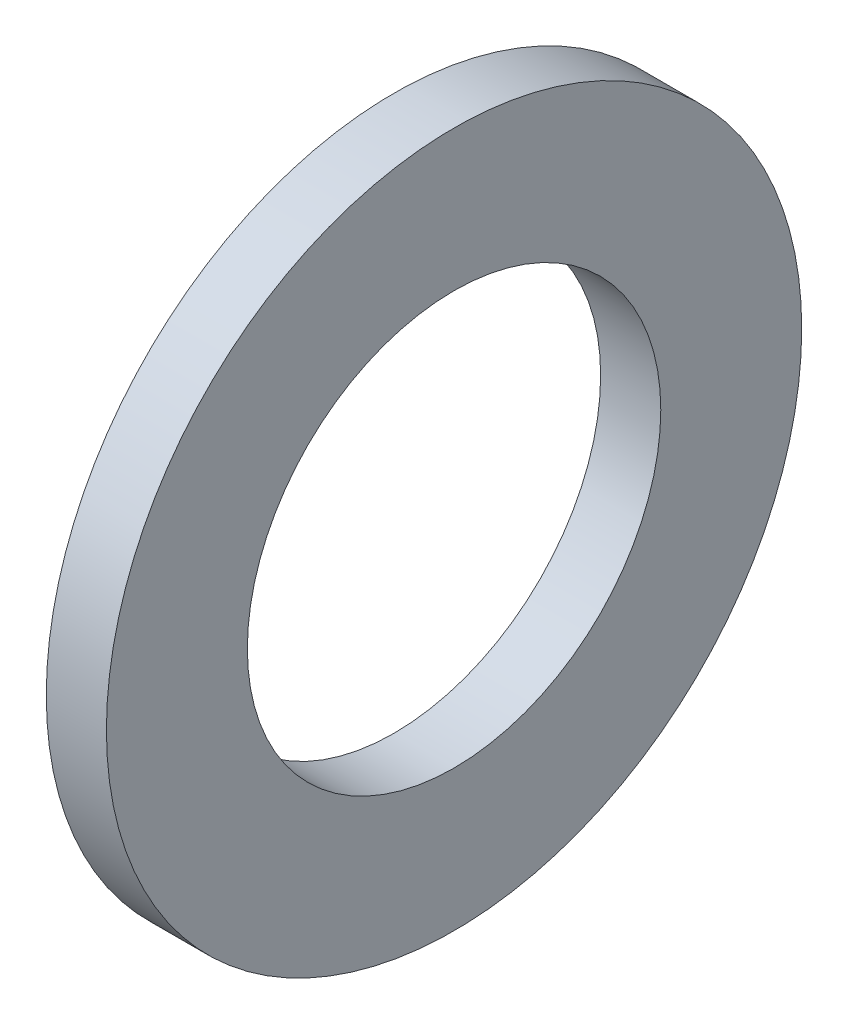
ISO-10303-21;
HEADER;
FILE_DESCRIPTION(('STEP AP214'),'2;1');
FILE_NAME('part.step','',(''),(''),'','','');
FILE_SCHEMA(('AUTOMOTIVE_DESIGN { 1 0 10303 214 1 1 1 1 }'));
ENDSEC;
DATA;
#1=APPLICATION_CONTEXT('core data for automotive mechanical design processes');
#2=APPLICATION_PROTOCOL_DEFINITION('international standard','automotive_design',2000,#1);
#3=PRODUCT_CONTEXT('',#1,'mechanical');
#4=PRODUCT('Part','Part','',(#3));
#5=PRODUCT_RELATED_PRODUCT_CATEGORY('part','',(#4));
#6=PRODUCT_DEFINITION_FORMATION('','',#4);
#7=PRODUCT_DEFINITION_CONTEXT('part definition',#1,'design');
#8=PRODUCT_DEFINITION('design','',#6,#7);
#9=PRODUCT_DEFINITION_SHAPE('','',#8);
#10=(LENGTH_UNIT() NAMED_UNIT(*) SI_UNIT(.MILLI.,.METRE.));
#11=(NAMED_UNIT(*) PLANE_ANGLE_UNIT() SI_UNIT($,.RADIAN.));
#12=(NAMED_UNIT(*) SI_UNIT($,.STERADIAN.) SOLID_ANGLE_UNIT());
#13=UNCERTAINTY_MEASURE_WITH_UNIT(LENGTH_MEASURE(1.E-05),#10,'distance_accuracy_value','');
#14=(GEOMETRIC_REPRESENTATION_CONTEXT(3) GLOBAL_UNCERTAINTY_ASSIGNED_CONTEXT((#13)) GLOBAL_UNIT_ASSIGNED_CONTEXT((#10,
#11,#12)) REPRESENTATION_CONTEXT('',''));
#15=CARTESIAN_POINT('',(0.,0.,0.));
#16=DIRECTION('',(0.,0.,1.));
#17=DIRECTION('',(1.,0.,0.));
#18=AXIS2_PLACEMENT_3D('',#15,#16,#17);
#19=CARTESIAN_POINT('',(-34.9249999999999,0.,0.));
#20=DIRECTION('',(-1.,0.,0.));
#21=DIRECTION('',(0.,0.,1.));
#22=AXIS2_PLACEMENT_3D('',#19,#20,#21);
#23=CYLINDRICAL_SURFACE('',#22,11.);
#24=CARTESIAN_POINT('',(0.,0.,0.));
#25=DIRECTION('',(-1.,0.,0.));
#26=DIRECTION('',(0.,0.,1.));
#27=AXIS2_PLACEMENT_3D('',#24,#25,#26);
#28=CIRCLE('',#27,11.);
#29=CARTESIAN_POINT('',(0.,0.,11.));
#30=VERTEX_POINT('',#29);
#31=EDGE_CURVE('E10',#30,#30,#28,.T.);
#32=ORIENTED_EDGE('',*,*,#31,.F.);
#33=EDGE_LOOP('',(#32));
#34=FACE_BOUND('',#33,.T.);
#35=CARTESIAN_POINT('',(-3.2,0.,0.));
#36=DIRECTION('',(-1.,0.,0.));
#37=DIRECTION('',(0.,0.,1.));
#38=AXIS2_PLACEMENT_3D('',#35,#36,#37);
#39=CIRCLE('',#38,11.);
#40=CARTESIAN_POINT('',(-3.2,0.,11.));
#41=VERTEX_POINT('',#40);
#42=EDGE_CURVE('E45',#41,#41,#39,.T.);
#43=ORIENTED_EDGE('',*,*,#42,.T.);
#44=EDGE_LOOP('',(#43));
#45=FACE_BOUND('',#44,.T.);
#46=ADVANCED_FACE('F31',(#34,#45),#23,.F.);
#47=CARTESIAN_POINT('',(0.,11.,0.));
#48=DIRECTION('',(-1.,0.,0.));
#49=DIRECTION('',(0.,0.,1.));
#50=AXIS2_PLACEMENT_3D('',#47,#48,#49);
#51=PLANE('',#50);
#52=CARTESIAN_POINT('',(0.,0.,0.));
#53=DIRECTION('',(-1.,0.,0.));
#54=DIRECTION('',(0.,0.,1.));
#55=AXIS2_PLACEMENT_3D('',#52,#53,#54);
#56=CIRCLE('',#55,18.5);
#57=CARTESIAN_POINT('',(0.,0.,18.5));
#58=VERTEX_POINT('',#57);
#59=EDGE_CURVE('E37',#58,#58,#56,.T.);
#60=ORIENTED_EDGE('',*,*,#59,.F.);
#61=EDGE_LOOP('',(#60));
#62=FACE_BOUND('',#61,.T.);
#63=ORIENTED_EDGE('',*,*,#31,.T.);
#64=EDGE_LOOP('',(#63));
#65=FACE_BOUND('',#64,.T.);
#66=ADVANCED_FACE('F60',(#62,#65),#51,.F.);
#67=CARTESIAN_POINT('',(-34.9249999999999,0.,0.));
#68=DIRECTION('',(-1.,0.,0.));
#69=DIRECTION('',(0.,0.,1.));
#70=AXIS2_PLACEMENT_3D('',#67,#68,#69);
#71=CYLINDRICAL_SURFACE('',#70,18.5);
#72=CARTESIAN_POINT('',(-3.2,0.,0.));
#73=DIRECTION('',(-1.,0.,0.));
#74=DIRECTION('',(0.,0.,1.));
#75=AXIS2_PLACEMENT_3D('',#72,#73,#74);
#76=CIRCLE('',#75,18.5);
#77=CARTESIAN_POINT('',(-3.2,0.,18.5));
#78=VERTEX_POINT('',#77);
#79=EDGE_CURVE('E41',#78,#78,#76,.T.);
#80=ORIENTED_EDGE('',*,*,#79,.F.);
#81=EDGE_LOOP('',(#80));
#82=FACE_BOUND('',#81,.T.);
#83=ORIENTED_EDGE('',*,*,#59,.T.);
#84=EDGE_LOOP('',(#83));
#85=FACE_BOUND('',#84,.T.);
#86=ADVANCED_FACE('F55',(#82,#85),#71,.T.);
#87=CARTESIAN_POINT('',(-3.2,18.5,0.));
#88=DIRECTION('',(1.,0.,0.));
#89=DIRECTION('',(0.,0.,-1.));
#90=AXIS2_PLACEMENT_3D('',#87,#88,#89);
#91=PLANE('',#90);
#92=ORIENTED_EDGE('',*,*,#42,.F.);
#93=EDGE_LOOP('',(#92));
#94=FACE_BOUND('',#93,.T.);
#95=ORIENTED_EDGE('',*,*,#79,.T.);
#96=EDGE_LOOP('',(#95));
#97=FACE_BOUND('',#96,.T.);
#98=ADVANCED_FACE('F52',(#94,#97),#91,.F.);
#99=CLOSED_SHELL('',(#46,#66,#86,#98));
#100=MANIFOLD_SOLID_BREP('B2',#99);
#101=ADVANCED_BREP_SHAPE_REPRESENTATION('',(#18,#100),#14);
#102=SHAPE_DEFINITION_REPRESENTATION(#9,#101);
ENDSEC;
END-ISO-10303-21;
